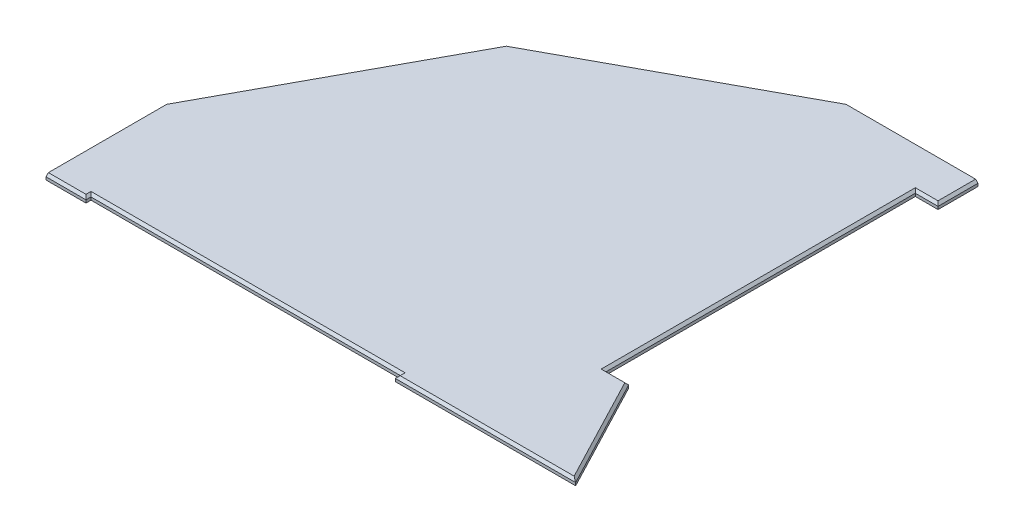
ISO-10303-21;
HEADER;
FILE_DESCRIPTION(('STEP AP214'),'2;1');
FILE_NAME('part.step','',(''),(''),'','','');
FILE_SCHEMA(('AUTOMOTIVE_DESIGN { 1 0 10303 214 1 1 1 1 }'));
ENDSEC;
DATA;
#1=APPLICATION_CONTEXT('core data for automotive mechanical design processes');
#2=APPLICATION_PROTOCOL_DEFINITION('international standard','automotive_design',2000,#1);
#3=PRODUCT_CONTEXT('',#1,'mechanical');
#4=PRODUCT('Part','Part','',(#3));
#5=PRODUCT_RELATED_PRODUCT_CATEGORY('part','',(#4));
#6=PRODUCT_DEFINITION_FORMATION('','',#4);
#7=PRODUCT_DEFINITION_CONTEXT('part definition',#1,'design');
#8=PRODUCT_DEFINITION('design','',#6,#7);
#9=PRODUCT_DEFINITION_SHAPE('','',#8);
#10=(LENGTH_UNIT() NAMED_UNIT(*) SI_UNIT(.MILLI.,.METRE.));
#11=(NAMED_UNIT(*) PLANE_ANGLE_UNIT() SI_UNIT($,.RADIAN.));
#12=(NAMED_UNIT(*) SI_UNIT($,.STERADIAN.) SOLID_ANGLE_UNIT());
#13=UNCERTAINTY_MEASURE_WITH_UNIT(LENGTH_MEASURE(1.E-05),#10,'distance_accuracy_value','');
#14=(GEOMETRIC_REPRESENTATION_CONTEXT(3) GLOBAL_UNCERTAINTY_ASSIGNED_CONTEXT((#13)) GLOBAL_UNIT_ASSIGNED_CONTEXT((#10,
#11,#12)) REPRESENTATION_CONTEXT('',''));
#15=CARTESIAN_POINT('',(0.,0.,0.));
#16=DIRECTION('',(0.,0.,1.));
#17=DIRECTION('',(1.,0.,0.));
#18=AXIS2_PLACEMENT_3D('',#15,#16,#17);
#19=CARTESIAN_POINT('',(145.16828136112,9.525,-591.552652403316));
#20=DIRECTION('',(0.476973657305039,0.,0.878917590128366));
#21=DIRECTION('',(0.878917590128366,0.,-0.47697365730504));
#22=AXIS2_PLACEMENT_3D('',#19,#20,#21);
#23=PLANE('',#22);
#24=DIRECTION('',(-0.878917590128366,0.,0.476973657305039));
#25=VECTOR('',#24,1.);
#26=CARTESIAN_POINT('',(145.16828136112,-9.525,-591.552652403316));
#27=LINE('',#26,#25);
#28=CARTESIAN_POINT('',(145.16828136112,-9.525,-591.552652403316));
#29=VERTEX_POINT('',#28);
#30=CARTESIAN_POINT('',(-405.744758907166,-9.525,-292.581496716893));
#31=VERTEX_POINT('',#30);
#32=EDGE_CURVE('E237',#29,#31,#27,.T.);
#33=ORIENTED_EDGE('',*,*,#32,.T.);
#34=DIRECTION('',(0.,-1.,0.));
#35=VECTOR('',#34,1.);
#36=CARTESIAN_POINT('',(-405.744758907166,9.525,-292.581496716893));
#37=LINE('',#36,#35);
#38=CARTESIAN_POINT('',(-405.744758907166,9.525,-292.581496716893));
#39=VERTEX_POINT('',#38);
#40=EDGE_CURVE('E220',#39,#31,#37,.T.);
#41=ORIENTED_EDGE('',*,*,#40,.F.);
#42=DIRECTION('',(-0.878917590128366,0.,0.476973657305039));
#43=VECTOR('',#42,1.);
#44=CARTESIAN_POINT('',(145.16828136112,9.525,-591.552652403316));
#45=LINE('',#44,#43);
#46=CARTESIAN_POINT('',(145.16828136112,9.525,-591.552652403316));
#47=VERTEX_POINT('',#46);
#48=EDGE_CURVE('E221',#47,#39,#45,.T.);
#49=ORIENTED_EDGE('',*,*,#48,.F.);
#50=DIRECTION('',(0.,-1.,0.));
#51=VECTOR('',#50,1.);
#52=CARTESIAN_POINT('',(145.16828136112,9.525,-591.552652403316));
#53=LINE('',#52,#51);
#54=EDGE_CURVE('E395',#47,#29,#53,.T.);
#55=ORIENTED_EDGE('',*,*,#54,.T.);
#56=EDGE_LOOP('',(#33,#41,#49,#55));
#57=FACE_BOUND('',#56,.T.);
#58=ADVANCED_FACE('F43',(#57),#23,.F.);
#59=CARTESIAN_POINT('',(-405.744758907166,9.525,-292.581496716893));
#60=DIRECTION('',(0.878917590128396,0.,0.476973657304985));
#61=DIRECTION('',(0.476973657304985,0.,-0.878917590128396));
#62=AXIS2_PLACEMENT_3D('',#59,#60,#61);
#63=PLANE('',#62);
#64=DIRECTION('',(-0.476973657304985,0.,0.878917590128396));
#65=VECTOR('',#64,1.);
#66=CARTESIAN_POINT('',(-405.744758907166,-9.525,-292.581496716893));
#67=LINE('',#66,#65);
#68=CARTESIAN_POINT('',(-704.715914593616,-9.525,258.331543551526));
#69=VERTEX_POINT('',#68);
#70=EDGE_CURVE('E398',#31,#69,#67,.T.);
#71=ORIENTED_EDGE('',*,*,#70,.T.);
#72=DIRECTION('',(0.,-1.,0.));
#73=VECTOR('',#72,1.);
#74=CARTESIAN_POINT('',(-704.715914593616,9.525,258.331543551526));
#75=LINE('',#74,#73);
#76=CARTESIAN_POINT('',(-704.715914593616,9.525,258.331543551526));
#77=VERTEX_POINT('',#76);
#78=EDGE_CURVE('E219',#77,#69,#75,.T.);
#79=ORIENTED_EDGE('',*,*,#78,.F.);
#80=DIRECTION('',(-0.476973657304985,0.,0.878917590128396));
#81=VECTOR('',#80,1.);
#82=CARTESIAN_POINT('',(-405.744758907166,9.525,-292.581496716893));
#83=LINE('',#82,#81);
#84=EDGE_CURVE('E213',#39,#77,#83,.T.);
#85=ORIENTED_EDGE('',*,*,#84,.F.);
#86=ORIENTED_EDGE('',*,*,#40,.T.);
#87=EDGE_LOOP('',(#71,#79,#85,#86));
#88=FACE_BOUND('',#87,.T.);
#89=ADVANCED_FACE('F214',(#88),#63,.F.);
#90=CARTESIAN_POINT('',(-704.715914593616,9.525,560.23764759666));
#91=DIRECTION('',(1.,0.,0.));
#92=DIRECTION('',(0.,0.,-1.));
#93=AXIS2_PLACEMENT_3D('',#90,#91,#92);
#94=PLANE('',#93);
#95=DIRECTION('',(0.,0.,1.));
#96=VECTOR('',#95,1.);
#97=CARTESIAN_POINT('',(-704.715914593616,-9.525,560.23764759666));
#98=LINE('',#97,#96);
#99=CARTESIAN_POINT('',(-704.715914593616,-9.525,554.23764759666));
#100=VERTEX_POINT('',#99);
#101=EDGE_CURVE('E402',#69,#100,#98,.T.);
#102=ORIENTED_EDGE('',*,*,#101,.T.);
#103=DIRECTION('',(0.,0.707106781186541,0.707106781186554));
#104=VECTOR('',#103,1.);
#105=CARTESIAN_POINT('',(-704.715914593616,-3.525,560.23764759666));
#106=LINE('',#105,#104);
#107=CARTESIAN_POINT('',(-704.715914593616,-3.52499999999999,560.23764759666));
#108=VERTEX_POINT('',#107);
#109=EDGE_CURVE('E267',#100,#108,#106,.T.);
#110=ORIENTED_EDGE('',*,*,#109,.T.);
#111=DIRECTION('',(0.,-1.,0.));
#112=VECTOR('',#111,1.);
#113=CARTESIAN_POINT('',(-704.715914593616,9.525,560.23764759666));
#114=LINE('',#113,#112);
#115=CARTESIAN_POINT('',(-704.715914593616,3.525,560.23764759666));
#116=VERTEX_POINT('',#115);
#117=EDGE_CURVE('E243',#116,#108,#114,.T.);
#118=ORIENTED_EDGE('',*,*,#117,.F.);
#119=DIRECTION('',(0.,-0.707106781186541,0.707106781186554));
#120=VECTOR('',#119,1.);
#121=CARTESIAN_POINT('',(-704.715914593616,9.525,554.23764759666));
#122=LINE('',#121,#120);
#123=CARTESIAN_POINT('',(-704.715914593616,9.525,554.23764759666));
#124=VERTEX_POINT('',#123);
#125=EDGE_CURVE('E270',#116,#124,#122,.F.);
#126=ORIENTED_EDGE('',*,*,#125,.T.);
#127=DIRECTION('',(0.,0.,1.));
#128=VECTOR('',#127,1.);
#129=CARTESIAN_POINT('',(-704.715914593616,9.525,560.23764759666));
#130=LINE('',#129,#128);
#131=EDGE_CURVE('E224',#77,#124,#130,.T.);
#132=ORIENTED_EDGE('',*,*,#131,.F.);
#133=ORIENTED_EDGE('',*,*,#78,.T.);
#134=EDGE_LOOP('',(#102,#110,#118,#126,#132,#133));
#135=FACE_BOUND('',#134,.T.);
#136=ADVANCED_FACE('F528',(#135),#94,.F.);
#137=CARTESIAN_POINT('',(-604.715914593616,9.525,560.23764759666));
#138=DIRECTION('',(0.,0.,-1.));
#139=DIRECTION('',(-1.,0.,0.));
#140=AXIS2_PLACEMENT_3D('',#137,#138,#139);
#141=PLANE('',#140);
#142=ORIENTED_EDGE('',*,*,#117,.T.);
#143=DIRECTION('',(1.,0.,0.));
#144=VECTOR('',#143,1.);
#145=CARTESIAN_POINT('',(-604.715914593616,-3.525,560.23764759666));
#146=LINE('',#145,#144);
#147=CARTESIAN_POINT('',(-604.715914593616,-3.52499999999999,560.23764759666));
#148=VERTEX_POINT('',#147);
#149=EDGE_CURVE('E239',#108,#148,#146,.T.);
#150=ORIENTED_EDGE('',*,*,#149,.T.);
#151=DIRECTION('',(0.,-1.,0.));
#152=VECTOR('',#151,1.);
#153=CARTESIAN_POINT('',(-604.715914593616,9.525,560.23764759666));
#154=LINE('',#153,#152);
#155=CARTESIAN_POINT('',(-604.715914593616,3.525,560.23764759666));
#156=VERTEX_POINT('',#155);
#157=EDGE_CURVE('E429',#156,#148,#154,.T.);
#158=ORIENTED_EDGE('',*,*,#157,.F.);
#159=DIRECTION('',(-1.,0.,0.));
#160=VECTOR('',#159,1.);
#161=CARTESIAN_POINT('',(-604.715914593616,3.525,560.23764759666));
#162=LINE('',#161,#160);
#163=EDGE_CURVE('E240',#156,#116,#162,.T.);
#164=ORIENTED_EDGE('',*,*,#163,.T.);
#165=EDGE_LOOP('',(#142,#150,#158,#164));
#166=FACE_BOUND('',#165,.T.);
#167=ADVANCED_FACE('F436',(#166),#141,.F.);
#168=CARTESIAN_POINT('',(-604.715914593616,9.525,547.71264759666));
#169=DIRECTION('',(-1.,0.,0.));
#170=DIRECTION('',(0.,0.,1.));
#171=AXIS2_PLACEMENT_3D('',#168,#169,#170);
#172=PLANE('',#171);
#173=ORIENTED_EDGE('',*,*,#157,.T.);
#174=DIRECTION('',(0.,0.,-1.));
#175=VECTOR('',#174,1.);
#176=CARTESIAN_POINT('',(-604.715914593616,-3.525,547.71264759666));
#177=LINE('',#176,#175);
#178=CARTESIAN_POINT('',(-604.715914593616,-3.52499999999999,547.71264759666));
#179=VERTEX_POINT('',#178);
#180=EDGE_CURVE('E272',#148,#179,#177,.T.);
#181=ORIENTED_EDGE('',*,*,#180,.T.);
#182=DIRECTION('',(0.,-1.,0.));
#183=VECTOR('',#182,1.);
#184=CARTESIAN_POINT('',(-604.715914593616,9.525,547.71264759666));
#185=LINE('',#184,#183);
#186=CARTESIAN_POINT('',(-604.715914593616,3.525,547.71264759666));
#187=VERTEX_POINT('',#186);
#188=EDGE_CURVE('E430',#187,#179,#185,.T.);
#189=ORIENTED_EDGE('',*,*,#188,.F.);
#190=DIRECTION('',(0.,0.,1.));
#191=VECTOR('',#190,1.);
#192=CARTESIAN_POINT('',(-604.715914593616,3.525,547.71264759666));
#193=LINE('',#192,#191);
#194=EDGE_CURVE('E271',#187,#156,#193,.T.);
#195=ORIENTED_EDGE('',*,*,#194,.T.);
#196=EDGE_LOOP('',(#173,#181,#189,#195));
#197=FACE_BOUND('',#196,.T.);
#198=ADVANCED_FACE('F452',(#197),#172,.F.);
#199=CARTESIAN_POINT('',(-604.715914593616,9.525,547.71264759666));
#200=DIRECTION('',(0.,0.,-1.));
#201=DIRECTION('',(-1.,0.,0.));
#202=AXIS2_PLACEMENT_3D('',#199,#200,#201);
#203=PLANE('',#202);
#204=ORIENTED_EDGE('',*,*,#188,.T.);
#205=DIRECTION('',(1.,0.,0.));
#206=VECTOR('',#205,1.);
#207=CARTESIAN_POINT('',(169.284085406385,-3.525,547.71264759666));
#208=LINE('',#207,#206);
#209=CARTESIAN_POINT('',(169.284085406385,-3.52499999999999,547.71264759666));
#210=VERTEX_POINT('',#209);
#211=EDGE_CURVE('E280',#179,#210,#208,.T.);
#212=ORIENTED_EDGE('',*,*,#211,.T.);
#213=DIRECTION('',(0.,-1.,0.));
#214=VECTOR('',#213,1.);
#215=CARTESIAN_POINT('',(169.284085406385,9.525,547.71264759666));
#216=LINE('',#215,#214);
#217=CARTESIAN_POINT('',(169.284085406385,3.525,547.71264759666));
#218=VERTEX_POINT('',#217);
#219=EDGE_CURVE('E424',#218,#210,#216,.T.);
#220=ORIENTED_EDGE('',*,*,#219,.F.);
#221=DIRECTION('',(-1.,0.,0.));
#222=VECTOR('',#221,1.);
#223=CARTESIAN_POINT('',(-604.715914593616,3.525,547.71264759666));
#224=LINE('',#223,#222);
#225=EDGE_CURVE('E274',#218,#187,#224,.T.);
#226=ORIENTED_EDGE('',*,*,#225,.T.);
#227=EDGE_LOOP('',(#204,#212,#220,#226));
#228=FACE_BOUND('',#227,.T.);
#229=ADVANCED_FACE('F457',(#228),#203,.F.);
#230=CARTESIAN_POINT('',(169.284085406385,9.525,547.71264759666));
#231=DIRECTION('',(1.,0.,0.));
#232=DIRECTION('',(0.,0.,-1.));
#233=AXIS2_PLACEMENT_3D('',#230,#231,#232);
#234=PLANE('',#233);
#235=ORIENTED_EDGE('',*,*,#219,.T.);
#236=DIRECTION('',(0.,0.,1.));
#237=VECTOR('',#236,1.);
#238=CARTESIAN_POINT('',(169.284085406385,-3.525,560.23764759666));
#239=LINE('',#238,#237);
#240=CARTESIAN_POINT('',(169.284085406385,-3.52499999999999,560.23764759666));
#241=VERTEX_POINT('',#240);
#242=EDGE_CURVE('E283',#210,#241,#239,.T.);
#243=ORIENTED_EDGE('',*,*,#242,.T.);
#244=DIRECTION('',(0.,-1.,0.));
#245=VECTOR('',#244,1.);
#246=CARTESIAN_POINT('',(169.284085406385,9.525,560.23764759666));
#247=LINE('',#246,#245);
#248=CARTESIAN_POINT('',(169.284085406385,3.525,560.23764759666));
#249=VERTEX_POINT('',#248);
#250=EDGE_CURVE('E423',#249,#241,#247,.T.);
#251=ORIENTED_EDGE('',*,*,#250,.F.);
#252=DIRECTION('',(0.,0.,-1.));
#253=VECTOR('',#252,1.);
#254=CARTESIAN_POINT('',(169.284085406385,3.525,547.71264759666));
#255=LINE('',#254,#253);
#256=EDGE_CURVE('E276',#249,#218,#255,.T.);
#257=ORIENTED_EDGE('',*,*,#256,.T.);
#258=EDGE_LOOP('',(#235,#243,#251,#257));
#259=FACE_BOUND('',#258,.T.);
#260=ADVANCED_FACE('F470',(#259),#234,.F.);
#261=CARTESIAN_POINT('',(620.484085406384,9.525,560.23764759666));
#262=DIRECTION('',(0.,0.,-1.));
#263=DIRECTION('',(-1.,0.,0.));
#264=AXIS2_PLACEMENT_3D('',#261,#262,#263);
#265=PLANE('',#264);
#266=ORIENTED_EDGE('',*,*,#250,.T.);
#267=DIRECTION('',(1.,0.,0.));
#268=VECTOR('',#267,1.);
#269=CARTESIAN_POINT('',(620.484085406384,-3.525,560.23764759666));
#270=LINE('',#269,#268);
#271=CARTESIAN_POINT('',(620.484085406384,-3.52499999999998,560.23764759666));
#272=VERTEX_POINT('',#271);
#273=EDGE_CURVE('E284',#241,#272,#270,.T.);
#274=ORIENTED_EDGE('',*,*,#273,.T.);
#275=DIRECTION('',(0.,-1.,0.));
#276=VECTOR('',#275,1.);
#277=CARTESIAN_POINT('',(620.484085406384,9.525,560.23764759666));
#278=LINE('',#277,#276);
#279=CARTESIAN_POINT('',(620.484085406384,3.52500000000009,560.23764759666));
#280=VERTEX_POINT('',#279);
#281=EDGE_CURVE('E416',#280,#272,#278,.T.);
#282=ORIENTED_EDGE('',*,*,#281,.F.);
#283=DIRECTION('',(-1.,0.,0.));
#284=VECTOR('',#283,1.);
#285=CARTESIAN_POINT('',(620.484085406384,3.525,560.23764759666));
#286=LINE('',#285,#284);
#287=EDGE_CURVE('E281',#280,#249,#286,.T.);
#288=ORIENTED_EDGE('',*,*,#287,.T.);
#289=EDGE_LOOP('',(#266,#274,#282,#288));
#290=FACE_BOUND('',#289,.T.);
#291=ADVANCED_FACE('F475',(#290),#265,.F.);
#292=CARTESIAN_POINT('',(620.484085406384,9.525,560.23764759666));
#293=DIRECTION('',(-0.886253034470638,0.,0.463201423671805));
#294=DIRECTION('',(0.463201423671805,0.,0.886253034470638));
#295=AXIS2_PLACEMENT_3D('',#292,#293,#294);
#296=PLANE('',#295);
#297=ORIENTED_EDGE('',*,*,#281,.T.);
#298=DIRECTION('',(-0.463201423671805,0.,-0.886253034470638));
#299=VECTOR('',#298,1.);
#300=CARTESIAN_POINT('',(475.296585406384,-3.52499999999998,282.447347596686));
#301=LINE('',#300,#299);
#302=CARTESIAN_POINT('',(475.296585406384,-3.52499999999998,282.447347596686));
#303=VERTEX_POINT('',#302);
#304=EDGE_CURVE('E310',#272,#303,#301,.T.);
#305=ORIENTED_EDGE('',*,*,#304,.T.);
#306=DIRECTION('',(0.,-1.,0.));
#307=VECTOR('',#306,1.);
#308=CARTESIAN_POINT('',(475.296585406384,9.525,282.447347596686));
#309=LINE('',#308,#307);
#310=CARTESIAN_POINT('',(475.296585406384,3.52500000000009,282.447347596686));
#311=VERTEX_POINT('',#310);
#312=EDGE_CURVE('E415',#311,#303,#309,.T.);
#313=ORIENTED_EDGE('',*,*,#312,.F.);
#314=DIRECTION('',(0.463201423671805,0.,0.886253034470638));
#315=VECTOR('',#314,1.);
#316=CARTESIAN_POINT('',(620.484085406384,3.52500000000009,560.23764759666));
#317=LINE('',#316,#315);
#318=EDGE_CURVE('E307',#311,#280,#317,.T.);
#319=ORIENTED_EDGE('',*,*,#318,.T.);
#320=EDGE_LOOP('',(#297,#305,#313,#319));
#321=FACE_BOUND('',#320,.T.);
#322=ADVANCED_FACE('F488',(#321),#296,.F.);
#323=CARTESIAN_POINT('',(418.496585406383,9.525,282.447347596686));
#324=DIRECTION('',(0.,0.,1.));
#325=DIRECTION('',(1.,0.,0.));
#326=AXIS2_PLACEMENT_3D('',#323,#324,#325);
#327=PLANE('',#326);
#328=ORIENTED_EDGE('',*,*,#312,.T.);
#329=DIRECTION('',(-1.,0.,0.));
#330=VECTOR('',#329,1.);
#331=CARTESIAN_POINT('',(418.496585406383,-3.525,282.447347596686));
#332=LINE('',#331,#330);
#333=CARTESIAN_POINT('',(418.496585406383,-3.52499999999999,282.447347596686));
#334=VERTEX_POINT('',#333);
#335=EDGE_CURVE('E305',#303,#334,#332,.T.);
#336=ORIENTED_EDGE('',*,*,#335,.T.);
#337=DIRECTION('',(0.,-1.,0.));
#338=VECTOR('',#337,1.);
#339=CARTESIAN_POINT('',(418.496585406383,9.525,282.447347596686));
#340=LINE('',#339,#338);
#341=CARTESIAN_POINT('',(418.496585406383,3.525,282.447347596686));
#342=VERTEX_POINT('',#341);
#343=EDGE_CURVE('E412',#342,#334,#340,.T.);
#344=ORIENTED_EDGE('',*,*,#343,.F.);
#345=DIRECTION('',(1.,0.,0.));
#346=VECTOR('',#345,1.);
#347=CARTESIAN_POINT('',(418.496585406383,3.525,282.447347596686));
#348=LINE('',#347,#346);
#349=EDGE_CURVE('E304',#342,#311,#348,.T.);
#350=ORIENTED_EDGE('',*,*,#349,.T.);
#351=EDGE_LOOP('',(#328,#336,#344,#350));
#352=FACE_BOUND('',#351,.T.);
#353=ADVANCED_FACE('F495',(#352),#327,.F.);
#354=CARTESIAN_POINT('',(418.496585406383,9.525,282.447347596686));
#355=DIRECTION('',(-1.,0.,0.));
#356=DIRECTION('',(0.,0.,1.));
#357=AXIS2_PLACEMENT_3D('',#354,#355,#356);
#358=PLANE('',#357);
#359=ORIENTED_EDGE('',*,*,#343,.T.);
#360=DIRECTION('',(0.,0.,-1.));
#361=VECTOR('',#360,1.);
#362=CARTESIAN_POINT('',(418.496585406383,-3.525,-491.552652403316));
#363=LINE('',#362,#361);
#364=CARTESIAN_POINT('',(418.496585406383,-3.52499999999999,-491.552652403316));
#365=VERTEX_POINT('',#364);
#366=EDGE_CURVE('E301',#334,#365,#363,.T.);
#367=ORIENTED_EDGE('',*,*,#366,.T.);
#368=DIRECTION('',(0.,-1.,0.));
#369=VECTOR('',#368,1.);
#370=CARTESIAN_POINT('',(418.496585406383,9.525,-491.552652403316));
#371=LINE('',#370,#369);
#372=CARTESIAN_POINT('',(418.496585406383,3.525,-491.552652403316));
#373=VERTEX_POINT('',#372);
#374=EDGE_CURVE('E407',#373,#365,#371,.T.);
#375=ORIENTED_EDGE('',*,*,#374,.F.);
#376=DIRECTION('',(0.,0.,1.));
#377=VECTOR('',#376,1.);
#378=CARTESIAN_POINT('',(418.496585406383,3.525,282.447347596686));
#379=LINE('',#378,#377);
#380=EDGE_CURVE('E297',#373,#342,#379,.T.);
#381=ORIENTED_EDGE('',*,*,#380,.T.);
#382=EDGE_LOOP('',(#359,#367,#375,#381));
#383=FACE_BOUND('',#382,.T.);
#384=ADVANCED_FACE('F506',(#383),#358,.F.);
#385=CARTESIAN_POINT('',(418.496585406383,9.525,-491.552652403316));
#386=DIRECTION('',(0.,0.,-1.));
#387=DIRECTION('',(-1.,0.,0.));
#388=AXIS2_PLACEMENT_3D('',#385,#386,#387);
#389=PLANE('',#388);
#390=ORIENTED_EDGE('',*,*,#374,.T.);
#391=DIRECTION('',(1.,0.,0.));
#392=VECTOR('',#391,1.);
#393=CARTESIAN_POINT('',(475.296585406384,-3.525,-491.552652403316));
#394=LINE('',#393,#392);
#395=CARTESIAN_POINT('',(475.296585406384,-3.52499999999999,-491.552652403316));
#396=VERTEX_POINT('',#395);
#397=EDGE_CURVE('E300',#365,#396,#394,.T.);
#398=ORIENTED_EDGE('',*,*,#397,.T.);
#399=DIRECTION('',(0.,-1.,0.));
#400=VECTOR('',#399,1.);
#401=CARTESIAN_POINT('',(475.296585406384,9.525,-491.552652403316));
#402=LINE('',#401,#400);
#403=CARTESIAN_POINT('',(475.296585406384,3.525,-491.552652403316));
#404=VERTEX_POINT('',#403);
#405=EDGE_CURVE('E408',#404,#396,#402,.T.);
#406=ORIENTED_EDGE('',*,*,#405,.F.);
#407=DIRECTION('',(-1.,0.,0.));
#408=VECTOR('',#407,1.);
#409=CARTESIAN_POINT('',(418.496585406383,3.525,-491.552652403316));
#410=LINE('',#409,#408);
#411=EDGE_CURVE('E293',#404,#373,#410,.T.);
#412=ORIENTED_EDGE('',*,*,#411,.T.);
#413=EDGE_LOOP('',(#390,#398,#406,#412));
#414=FACE_BOUND('',#413,.T.);
#415=ADVANCED_FACE('F508',(#414),#389,.F.);
#416=CARTESIAN_POINT('',(475.296585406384,9.525,-491.552652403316));
#417=DIRECTION('',(-1.,0.,0.));
#418=DIRECTION('',(0.,0.,1.));
#419=AXIS2_PLACEMENT_3D('',#416,#417,#418);
#420=PLANE('',#419);
#421=ORIENTED_EDGE('',*,*,#405,.T.);
#422=DIRECTION('',(0.,0.,-1.));
#423=VECTOR('',#422,1.);
#424=CARTESIAN_POINT('',(475.296585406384,-3.525,-591.552652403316));
#425=LINE('',#424,#423);
#426=CARTESIAN_POINT('',(475.296585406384,-3.52499999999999,-591.552652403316));
#427=VERTEX_POINT('',#426);
#428=EDGE_CURVE('E288',#396,#427,#425,.T.);
#429=ORIENTED_EDGE('',*,*,#428,.T.);
#430=DIRECTION('',(0.,-1.,0.));
#431=VECTOR('',#430,1.);
#432=CARTESIAN_POINT('',(475.296585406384,9.525,-591.552652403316));
#433=LINE('',#432,#431);
#434=CARTESIAN_POINT('',(475.296585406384,3.525,-591.552652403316));
#435=VERTEX_POINT('',#434);
#436=EDGE_CURVE('E392',#435,#427,#433,.T.);
#437=ORIENTED_EDGE('',*,*,#436,.F.);
#438=DIRECTION('',(0.,0.,1.));
#439=VECTOR('',#438,1.);
#440=CARTESIAN_POINT('',(475.296585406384,3.525,-491.552652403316));
#441=LINE('',#440,#439);
#442=EDGE_CURVE('E287',#435,#404,#441,.T.);
#443=ORIENTED_EDGE('',*,*,#442,.T.);
#444=EDGE_LOOP('',(#421,#429,#437,#443));
#445=FACE_BOUND('',#444,.T.);
#446=ADVANCED_FACE('F521',(#445),#420,.F.);
#447=CARTESIAN_POINT('',(475.296585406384,9.525,-591.552652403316));
#448=DIRECTION('',(0.,0.,1.));
#449=DIRECTION('',(1.,0.,0.));
#450=AXIS2_PLACEMENT_3D('',#447,#448,#449);
#451=PLANE('',#450);
#452=ORIENTED_EDGE('',*,*,#436,.T.);
#453=DIRECTION('',(-0.707106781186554,-0.707106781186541,0.));
#454=VECTOR('',#453,1.);
#455=CARTESIAN_POINT('',(475.296585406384,-3.525,-591.552652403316));
#456=LINE('',#455,#454);
#457=CARTESIAN_POINT('',(469.296585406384,-9.525,-591.552652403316));
#458=VERTEX_POINT('',#457);
#459=EDGE_CURVE('E291',#427,#458,#456,.T.);
#460=ORIENTED_EDGE('',*,*,#459,.T.);
#461=DIRECTION('',(-1.,0.,0.));
#462=VECTOR('',#461,1.);
#463=CARTESIAN_POINT('',(475.296585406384,-9.525,-591.552652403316));
#464=LINE('',#463,#462);
#465=EDGE_CURVE('E234',#458,#29,#464,.T.);
#466=ORIENTED_EDGE('',*,*,#465,.T.);
#467=ORIENTED_EDGE('',*,*,#54,.F.);
#468=DIRECTION('',(-1.,0.,0.));
#469=VECTOR('',#468,1.);
#470=CARTESIAN_POINT('',(475.296585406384,9.525,-591.552652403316));
#471=LINE('',#470,#469);
#472=CARTESIAN_POINT('',(469.296585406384,9.525,-591.552652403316));
#473=VERTEX_POINT('',#472);
#474=EDGE_CURVE('E227',#473,#47,#471,.T.);
#475=ORIENTED_EDGE('',*,*,#474,.F.);
#476=DIRECTION('',(-0.707106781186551,0.707106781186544,0.));
#477=VECTOR('',#476,1.);
#478=CARTESIAN_POINT('',(469.296585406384,9.525,-591.552652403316));
#479=LINE('',#478,#477);
#480=EDGE_CURVE('E292',#473,#435,#479,.F.);
#481=ORIENTED_EDGE('',*,*,#480,.T.);
#482=EDGE_LOOP('',(#452,#460,#466,#467,#475,#481));
#483=FACE_BOUND('',#482,.T.);
#484=ADVANCED_FACE('F388',(#483),#451,.F.);
#485=CARTESIAN_POINT('',(0.,9.525,0.));
#486=DIRECTION('',(0.,-1.,0.));
#487=DIRECTION('',(0.,0.,-1.));
#488=AXIS2_PLACEMENT_3D('',#485,#486,#487);
#489=PLANE('',#488);
#490=ORIENTED_EDGE('',*,*,#131,.T.);
#491=DIRECTION('',(1.,0.,0.));
#492=VECTOR('',#491,1.);
#493=CARTESIAN_POINT('',(0.,9.525,554.23764759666));
#494=LINE('',#493,#492);
#495=CARTESIAN_POINT('',(-610.715914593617,9.525,554.23764759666));
#496=VERTEX_POINT('',#495);
#497=EDGE_CURVE('E11',#124,#496,#494,.T.);
#498=ORIENTED_EDGE('',*,*,#497,.T.);
#499=DIRECTION('',(0.,0.,-1.));
#500=VECTOR('',#499,1.);
#501=CARTESIAN_POINT('',(-610.715914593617,9.525,0.));
#502=LINE('',#501,#500);
#503=CARTESIAN_POINT('',(-610.715914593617,9.525,541.71264759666));
#504=VERTEX_POINT('',#503);
#505=EDGE_CURVE('E52',#496,#504,#502,.T.);
#506=ORIENTED_EDGE('',*,*,#505,.T.);
#507=DIRECTION('',(1.,0.,0.));
#508=VECTOR('',#507,1.);
#509=CARTESIAN_POINT('',(0.,9.525,541.71264759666));
#510=LINE('',#509,#508);
#511=CARTESIAN_POINT('',(175.284085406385,9.525,541.71264759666));
#512=VERTEX_POINT('',#511);
#513=EDGE_CURVE('E324',#504,#512,#510,.T.);
#514=ORIENTED_EDGE('',*,*,#513,.T.);
#515=DIRECTION('',(0.,0.,1.));
#516=VECTOR('',#515,1.);
#517=CARTESIAN_POINT('',(175.284085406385,9.525,0.));
#518=LINE('',#517,#516);
#519=CARTESIAN_POINT('',(175.284085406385,9.525,554.23764759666));
#520=VERTEX_POINT('',#519);
#521=EDGE_CURVE('E323',#512,#520,#518,.T.);
#522=ORIENTED_EDGE('',*,*,#521,.T.);
#523=DIRECTION('',(1.,0.,0.));
#524=VECTOR('',#523,1.);
#525=CARTESIAN_POINT('',(0.,9.525,554.23764759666));
#526=LINE('',#525,#524);
#527=CARTESIAN_POINT('',(610.5781012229,9.525,554.23764759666));
#528=VERTEX_POINT('',#527);
#529=EDGE_CURVE('E321',#520,#528,#526,.T.);
#530=ORIENTED_EDGE('',*,*,#529,.T.);
#531=DIRECTION('',(-0.463201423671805,0.,-0.886253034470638));
#532=VECTOR('',#531,1.);
#533=CARTESIAN_POINT('',(252.053046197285,9.525,-131.73588726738));
#534=LINE('',#533,#532);
#535=CARTESIAN_POINT('',(471.662418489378,9.525,288.447347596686));
#536=VERTEX_POINT('',#535);
#537=EDGE_CURVE('E313',#528,#536,#534,.T.);
#538=ORIENTED_EDGE('',*,*,#537,.T.);
#539=DIRECTION('',(-1.,0.,0.));
#540=VECTOR('',#539,1.);
#541=CARTESIAN_POINT('',(0.,9.525,288.447347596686));
#542=LINE('',#541,#540);
#543=CARTESIAN_POINT('',(412.496585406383,9.525,288.447347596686));
#544=VERTEX_POINT('',#543);
#545=EDGE_CURVE('E311',#536,#544,#542,.T.);
#546=ORIENTED_EDGE('',*,*,#545,.T.);
#547=DIRECTION('',(0.,0.,-1.));
#548=VECTOR('',#547,1.);
#549=CARTESIAN_POINT('',(412.496585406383,9.525,0.));
#550=LINE('',#549,#548);
#551=CARTESIAN_POINT('',(412.496585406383,9.525,-497.552652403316));
#552=VERTEX_POINT('',#551);
#553=EDGE_CURVE('E312',#544,#552,#550,.T.);
#554=ORIENTED_EDGE('',*,*,#553,.T.);
#555=DIRECTION('',(1.,0.,0.));
#556=VECTOR('',#555,1.);
#557=CARTESIAN_POINT('',(0.,9.525,-497.552652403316));
#558=LINE('',#557,#556);
#559=CARTESIAN_POINT('',(469.296585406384,9.525,-497.552652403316));
#560=VERTEX_POINT('',#559);
#561=EDGE_CURVE('E320',#552,#560,#558,.T.);
#562=ORIENTED_EDGE('',*,*,#561,.T.);
#563=DIRECTION('',(0.,0.,-1.));
#564=VECTOR('',#563,1.);
#565=CARTESIAN_POINT('',(469.296585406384,9.525,0.));
#566=LINE('',#565,#564);
#567=EDGE_CURVE('E317',#560,#473,#566,.T.);
#568=ORIENTED_EDGE('',*,*,#567,.T.);
#569=ORIENTED_EDGE('',*,*,#474,.T.);
#570=ORIENTED_EDGE('',*,*,#48,.T.);
#571=ORIENTED_EDGE('',*,*,#84,.T.);
#572=EDGE_LOOP('',(#490,#498,#506,#514,#522,#530,#538,#546,#554,#562,#568,#569,#570,#571));
#573=FACE_BOUND('',#572,.T.);
#574=ADVANCED_FACE('F230',(#573),#489,.F.);
#575=CARTESIAN_POINT('',(0.,-9.525,0.));
#576=DIRECTION('',(0.,-1.,0.));
#577=DIRECTION('',(0.,0.,-1.));
#578=AXIS2_PLACEMENT_3D('',#575,#576,#577);
#579=PLANE('',#578);
#580=DIRECTION('',(0.,0.,1.));
#581=VECTOR('',#580,1.);
#582=CARTESIAN_POINT('',(-610.715914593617,-9.525,560.23764759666));
#583=LINE('',#582,#581);
#584=CARTESIAN_POINT('',(-610.715914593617,-9.525,541.71264759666));
#585=VERTEX_POINT('',#584);
#586=CARTESIAN_POINT('',(-610.715914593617,-9.525,554.23764759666));
#587=VERTEX_POINT('',#586);
#588=EDGE_CURVE('E263',#585,#587,#583,.T.);
#589=ORIENTED_EDGE('',*,*,#588,.T.);
#590=DIRECTION('',(-1.,0.,0.));
#591=VECTOR('',#590,1.);
#592=CARTESIAN_POINT('',(-704.715914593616,-9.525,554.23764759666));
#593=LINE('',#592,#591);
#594=EDGE_CURVE('E264',#587,#100,#593,.T.);
#595=ORIENTED_EDGE('',*,*,#594,.T.);
#596=ORIENTED_EDGE('',*,*,#101,.F.);
#597=ORIENTED_EDGE('',*,*,#70,.F.);
#598=ORIENTED_EDGE('',*,*,#32,.F.);
#599=ORIENTED_EDGE('',*,*,#465,.F.);
#600=DIRECTION('',(0.,0.,1.));
#601=VECTOR('',#600,1.);
#602=CARTESIAN_POINT('',(469.296585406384,-9.525,-491.552652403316));
#603=LINE('',#602,#601);
#604=CARTESIAN_POINT('',(469.296585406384,-9.525,-497.552652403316));
#605=VERTEX_POINT('',#604);
#606=EDGE_CURVE('E254',#458,#605,#603,.T.);
#607=ORIENTED_EDGE('',*,*,#606,.T.);
#608=DIRECTION('',(-1.,0.,0.));
#609=VECTOR('',#608,1.);
#610=CARTESIAN_POINT('',(418.496585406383,-9.525,-497.552652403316));
#611=LINE('',#610,#609);
#612=CARTESIAN_POINT('',(412.496585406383,-9.525,-497.552652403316));
#613=VERTEX_POINT('',#612);
#614=EDGE_CURVE('E251',#605,#613,#611,.T.);
#615=ORIENTED_EDGE('',*,*,#614,.T.);
#616=DIRECTION('',(0.,0.,1.));
#617=VECTOR('',#616,1.);
#618=CARTESIAN_POINT('',(412.496585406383,-9.525,282.447347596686));
#619=LINE('',#618,#617);
#620=CARTESIAN_POINT('',(412.496585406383,-9.525,288.447347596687));
#621=VERTEX_POINT('',#620);
#622=EDGE_CURVE('E253',#613,#621,#619,.T.);
#623=ORIENTED_EDGE('',*,*,#622,.T.);
#624=DIRECTION('',(1.,0.,0.));
#625=VECTOR('',#624,1.);
#626=CARTESIAN_POINT('',(475.296585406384,-9.525,288.447347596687));
#627=LINE('',#626,#625);
#628=CARTESIAN_POINT('',(471.662418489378,-9.525,288.447347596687));
#629=VERTEX_POINT('',#628);
#630=EDGE_CURVE('E248',#621,#629,#627,.T.);
#631=ORIENTED_EDGE('',*,*,#630,.T.);
#632=DIRECTION('',(0.463201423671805,0.,0.886253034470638));
#633=VECTOR('',#632,1.);
#634=CARTESIAN_POINT('',(615.16656719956,-9.525,563.016856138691));
#635=LINE('',#634,#633);
#636=CARTESIAN_POINT('',(610.5781012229,-9.525,554.23764759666));
#637=VERTEX_POINT('',#636);
#638=EDGE_CURVE('E247',#629,#637,#635,.T.);
#639=ORIENTED_EDGE('',*,*,#638,.T.);
#640=DIRECTION('',(-1.,0.,0.));
#641=VECTOR('',#640,1.);
#642=CARTESIAN_POINT('',(169.284085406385,-9.525,554.23764759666));
#643=LINE('',#642,#641);
#644=CARTESIAN_POINT('',(175.284085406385,-9.525,554.23764759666));
#645=VERTEX_POINT('',#644);
#646=EDGE_CURVE('E260',#637,#645,#643,.T.);
#647=ORIENTED_EDGE('',*,*,#646,.T.);
#648=DIRECTION('',(0.,0.,-1.));
#649=VECTOR('',#648,1.);
#650=CARTESIAN_POINT('',(175.284085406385,-9.525,547.71264759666));
#651=LINE('',#650,#649);
#652=CARTESIAN_POINT('',(175.284085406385,-9.525,541.71264759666));
#653=VERTEX_POINT('',#652);
#654=EDGE_CURVE('E259',#645,#653,#651,.T.);
#655=ORIENTED_EDGE('',*,*,#654,.T.);
#656=DIRECTION('',(-1.,0.,0.));
#657=VECTOR('',#656,1.);
#658=CARTESIAN_POINT('',(-604.715914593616,-9.525,541.71264759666));
#659=LINE('',#658,#657);
#660=EDGE_CURVE('E261',#653,#585,#659,.T.);
#661=ORIENTED_EDGE('',*,*,#660,.T.);
#662=EDGE_LOOP('',(#589,#595,#596,#597,#598,#599,#607,#615,#623,#631,#639,#647,#655,#661));
#663=FACE_BOUND('',#662,.T.);
#664=ADVANCED_FACE('F523',(#663),#579,.T.);
#665=CARTESIAN_POINT('',(475.296585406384,-3.525,-491.552652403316));
#666=DIRECTION('',(0.707106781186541,-0.707106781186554,0.));
#667=DIRECTION('',(0.,0.,1.));
#668=AXIS2_PLACEMENT_3D('',#665,#666,#667);
#669=PLANE('',#668);
#670=ORIENTED_EDGE('',*,*,#459,.F.);
#671=ORIENTED_EDGE('',*,*,#428,.F.);
#672=DIRECTION('',(0.577350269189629,0.577350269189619,0.577350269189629));
#673=VECTOR('',#672,1.);
#674=CARTESIAN_POINT('',(456.36325207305,-22.4583333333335,-510.48598573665));
#675=LINE('',#674,#673);
#676=EDGE_CURVE('E353',#605,#396,#675,.T.);
#677=ORIENTED_EDGE('',*,*,#676,.F.);
#678=ORIENTED_EDGE('',*,*,#606,.F.);
#679=EDGE_LOOP('',(#670,#671,#677,#678));
#680=FACE_BOUND('',#679,.T.);
#681=ADVANCED_FACE('F517',(#680),#669,.T.);
#682=CARTESIAN_POINT('',(418.496585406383,-3.525,-491.552652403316));
#683=DIRECTION('',(0.,-0.707106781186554,0.707106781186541));
#684=DIRECTION('',(-1.,0.,0.));
#685=AXIS2_PLACEMENT_3D('',#682,#683,#684);
#686=PLANE('',#685);
#687=ORIENTED_EDGE('',*,*,#676,.T.);
#688=ORIENTED_EDGE('',*,*,#397,.F.);
#689=DIRECTION('',(0.577350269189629,0.577350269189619,0.577350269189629));
#690=VECTOR('',#689,1.);
#691=CARTESIAN_POINT('',(418.496585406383,-3.525,-491.552652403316));
#692=LINE('',#691,#690);
#693=EDGE_CURVE('E346',#613,#365,#692,.T.);
#694=ORIENTED_EDGE('',*,*,#693,.F.);
#695=ORIENTED_EDGE('',*,*,#614,.F.);
#696=EDGE_LOOP('',(#687,#688,#694,#695));
#697=FACE_BOUND('',#696,.T.);
#698=ADVANCED_FACE('F515',(#697),#686,.T.);
#699=CARTESIAN_POINT('',(418.496585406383,-3.525,282.447347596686));
#700=DIRECTION('',(0.707106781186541,-0.707106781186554,0.));
#701=DIRECTION('',(0.,0.,1.));
#702=AXIS2_PLACEMENT_3D('',#699,#700,#701);
#703=PLANE('',#702);
#704=ORIENTED_EDGE('',*,*,#693,.T.);
#705=ORIENTED_EDGE('',*,*,#366,.F.);
#706=DIRECTION('',(0.577350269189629,0.577350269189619,-0.577350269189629));
#707=VECTOR('',#706,1.);
#708=CARTESIAN_POINT('',(418.496585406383,-3.525,282.447347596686));
#709=LINE('',#708,#707);
#710=EDGE_CURVE('E345',#621,#334,#709,.T.);
#711=ORIENTED_EDGE('',*,*,#710,.F.);
#712=ORIENTED_EDGE('',*,*,#622,.F.);
#713=EDGE_LOOP('',(#704,#705,#711,#712));
#714=FACE_BOUND('',#713,.T.);
#715=ADVANCED_FACE('F505',(#714),#703,.T.);
#716=CARTESIAN_POINT('',(418.496585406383,-3.525,282.447347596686));
#717=DIRECTION('',(0.,-0.707106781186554,-0.707106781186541));
#718=DIRECTION('',(1.,0.,0.));
#719=AXIS2_PLACEMENT_3D('',#716,#717,#718);
#720=PLANE('',#719);
#721=ORIENTED_EDGE('',*,*,#710,.T.);
#722=ORIENTED_EDGE('',*,*,#335,.F.);
#723=DIRECTION('',(0.393701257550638,0.649999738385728,-0.64999973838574));
#724=VECTOR('',#723,1.);
#725=CARTESIAN_POINT('',(426.712621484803,-83.7369963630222,362.65934395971));
#726=LINE('',#725,#724);
#727=EDGE_CURVE('E342',#629,#303,#726,.T.);
#728=ORIENTED_EDGE('',*,*,#727,.F.);
#729=ORIENTED_EDGE('',*,*,#630,.F.);
#730=EDGE_LOOP('',(#721,#722,#728,#729));
#731=FACE_BOUND('',#730,.T.);
#732=ADVANCED_FACE('F497',(#731),#720,.T.);
#733=CARTESIAN_POINT('',(620.484085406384,-3.525,560.23764759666));
#734=DIRECTION('',(0.62667553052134,-0.707106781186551,-0.327532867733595));
#735=DIRECTION('',(0.463201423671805,0.,0.886253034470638));
#736=AXIS2_PLACEMENT_3D('',#733,#734,#735);
#737=PLANE('',#736);
#738=ORIENTED_EDGE('',*,*,#727,.T.);
#739=ORIENTED_EDGE('',*,*,#304,.F.);
#740=DIRECTION('',(-0.759467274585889,-0.460005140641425,-0.460005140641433));
#741=VECTOR('',#740,1.);
#742=CARTESIAN_POINT('',(620.484085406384,-3.525,560.23764759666));
#743=LINE('',#742,#741);
#744=EDGE_CURVE('E337',#637,#272,#743,.F.);
#745=ORIENTED_EDGE('',*,*,#744,.F.);
#746=ORIENTED_EDGE('',*,*,#638,.F.);
#747=EDGE_LOOP('',(#738,#739,#745,#746));
#748=FACE_BOUND('',#747,.T.);
#749=ADVANCED_FACE('F482',(#748),#737,.T.);
#750=CARTESIAN_POINT('',(620.484085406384,-3.525,560.23764759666));
#751=DIRECTION('',(0.,-0.707106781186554,0.707106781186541));
#752=DIRECTION('',(-1.,0.,0.));
#753=AXIS2_PLACEMENT_3D('',#750,#751,#752);
#754=PLANE('',#753);
#755=ORIENTED_EDGE('',*,*,#744,.T.);
#756=ORIENTED_EDGE('',*,*,#273,.F.);
#757=DIRECTION('',(0.577350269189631,-0.577350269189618,-0.577350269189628));
#758=VECTOR('',#757,1.);
#759=CARTESIAN_POINT('',(319.684085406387,-153.924999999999,409.837647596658));
#760=LINE('',#759,#758);
#761=EDGE_CURVE('E338',#645,#241,#760,.F.);
#762=ORIENTED_EDGE('',*,*,#761,.F.);
#763=ORIENTED_EDGE('',*,*,#646,.F.);
#764=EDGE_LOOP('',(#755,#756,#762,#763));
#765=FACE_BOUND('',#764,.T.);
#766=ADVANCED_FACE('F476',(#765),#754,.T.);
#767=CARTESIAN_POINT('',(169.284085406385,-3.525,547.71264759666));
#768=DIRECTION('',(-0.707106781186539,-0.707106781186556,0.));
#769=DIRECTION('',(0.,0.,-1.));
#770=AXIS2_PLACEMENT_3D('',#767,#768,#769);
#771=PLANE('',#770);
#772=ORIENTED_EDGE('',*,*,#761,.T.);
#773=ORIENTED_EDGE('',*,*,#242,.F.);
#774=DIRECTION('',(0.577350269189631,-0.577350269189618,-0.577350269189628));
#775=VECTOR('',#774,1.);
#776=CARTESIAN_POINT('',(-88.7159145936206,254.474999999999,805.712647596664));
#777=LINE('',#776,#775);
#778=EDGE_CURVE('E334',#653,#210,#777,.F.);
#779=ORIENTED_EDGE('',*,*,#778,.F.);
#780=ORIENTED_EDGE('',*,*,#654,.F.);
#781=EDGE_LOOP('',(#772,#773,#779,#780));
#782=FACE_BOUND('',#781,.T.);
#783=ADVANCED_FACE('F466',(#782),#771,.T.);
#784=CARTESIAN_POINT('',(-604.715914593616,-3.525,547.71264759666));
#785=DIRECTION('',(0.,-0.707106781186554,0.707106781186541));
#786=DIRECTION('',(-1.,0.,0.));
#787=AXIS2_PLACEMENT_3D('',#784,#785,#786);
#788=PLANE('',#787);
#789=ORIENTED_EDGE('',*,*,#778,.T.);
#790=ORIENTED_EDGE('',*,*,#211,.F.);
#791=DIRECTION('',(-0.577350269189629,-0.577350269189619,-0.577350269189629));
#792=VECTOR('',#791,1.);
#793=CARTESIAN_POINT('',(-604.715914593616,-3.525,547.71264759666));
#794=LINE('',#793,#792);
#795=EDGE_CURVE('E329',#585,#179,#794,.F.);
#796=ORIENTED_EDGE('',*,*,#795,.F.);
#797=ORIENTED_EDGE('',*,*,#660,.F.);
#798=EDGE_LOOP('',(#789,#790,#796,#797));
#799=FACE_BOUND('',#798,.T.);
#800=ADVANCED_FACE('F458',(#799),#788,.T.);
#801=CARTESIAN_POINT('',(-604.715914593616,-3.525,547.71264759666));
#802=DIRECTION('',(0.707106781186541,-0.707106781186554,0.));
#803=DIRECTION('',(0.,0.,1.));
#804=AXIS2_PLACEMENT_3D('',#801,#802,#803);
#805=PLANE('',#804);
#806=ORIENTED_EDGE('',*,*,#795,.T.);
#807=ORIENTED_EDGE('',*,*,#180,.F.);
#808=DIRECTION('',(-0.577350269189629,-0.577350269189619,-0.577350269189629));
#809=VECTOR('',#808,1.);
#810=CARTESIAN_POINT('',(-608.890914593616,-7.69999999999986,556.06264759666));
#811=LINE('',#810,#809);
#812=EDGE_CURVE('E327',#587,#148,#811,.F.);
#813=ORIENTED_EDGE('',*,*,#812,.F.);
#814=ORIENTED_EDGE('',*,*,#588,.F.);
#815=EDGE_LOOP('',(#806,#807,#813,#814));
#816=FACE_BOUND('',#815,.T.);
#817=ADVANCED_FACE('F446',(#816),#805,.T.);
#818=CARTESIAN_POINT('',(-604.715914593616,-3.525,560.23764759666));
#819=DIRECTION('',(0.,-0.707106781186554,0.707106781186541));
#820=DIRECTION('',(-1.,0.,0.));
#821=AXIS2_PLACEMENT_3D('',#818,#819,#820);
#822=PLANE('',#821);
#823=ORIENTED_EDGE('',*,*,#109,.F.);
#824=ORIENTED_EDGE('',*,*,#594,.F.);
#825=ORIENTED_EDGE('',*,*,#812,.T.);
#826=ORIENTED_EDGE('',*,*,#149,.F.);
#827=EDGE_LOOP('',(#823,#824,#825,#826));
#828=FACE_BOUND('',#827,.T.);
#829=ADVANCED_FACE('F445',(#828),#822,.T.);
#830=CARTESIAN_POINT('',(469.296585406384,9.525,0.));
#831=DIRECTION('',(-0.707106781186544,-0.707106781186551,0.));
#832=DIRECTION('',(0.,0.,-1.));
#833=AXIS2_PLACEMENT_3D('',#830,#831,#832);
#834=PLANE('',#833);
#835=ORIENTED_EDGE('',*,*,#480,.F.);
#836=ORIENTED_EDGE('',*,*,#567,.F.);
#837=DIRECTION('',(-0.577350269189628,0.577350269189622,-0.577350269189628));
#838=VECTOR('',#837,1.);
#839=CARTESIAN_POINT('',(312.864390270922,165.957195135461,-653.984847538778));
#840=LINE('',#839,#838);
#841=EDGE_CURVE('E48',#404,#560,#840,.T.);
#842=ORIENTED_EDGE('',*,*,#841,.F.);
#843=ORIENTED_EDGE('',*,*,#442,.F.);
#844=EDGE_LOOP('',(#835,#836,#842,#843));
#845=FACE_BOUND('',#844,.T.);
#846=ADVANCED_FACE('F46',(#845),#834,.F.);
#847=CARTESIAN_POINT('',(0.,9.525,-497.552652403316));
#848=DIRECTION('',(0.,-0.707106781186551,-0.707106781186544));
#849=DIRECTION('',(1.,0.,0.));
#850=AXIS2_PLACEMENT_3D('',#847,#848,#849);
#851=PLANE('',#850);
#852=ORIENTED_EDGE('',*,*,#841,.T.);
#853=ORIENTED_EDGE('',*,*,#561,.F.);
#854=DIRECTION('',(-0.577350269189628,0.577350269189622,-0.577350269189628));
#855=VECTOR('',#854,1.);
#856=CARTESIAN_POINT('',(274.997723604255,147.023861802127,-635.051514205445));
#857=LINE('',#856,#855);
#858=EDGE_CURVE('E375',#373,#552,#857,.T.);
#859=ORIENTED_EDGE('',*,*,#858,.F.);
#860=ORIENTED_EDGE('',*,*,#411,.F.);
#861=EDGE_LOOP('',(#852,#853,#859,#860));
#862=FACE_BOUND('',#861,.T.);
#863=ADVANCED_FACE('F382',(#862),#851,.F.);
#864=CARTESIAN_POINT('',(412.496585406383,9.525,0.));
#865=DIRECTION('',(-0.707106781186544,-0.707106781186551,0.));
#866=DIRECTION('',(0.,0.,-1.));
#867=AXIS2_PLACEMENT_3D('',#864,#865,#866);
#868=PLANE('',#867);
#869=ORIENTED_EDGE('',*,*,#858,.T.);
#870=ORIENTED_EDGE('',*,*,#553,.F.);
#871=DIRECTION('',(-0.577350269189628,0.577350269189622,0.577350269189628));
#872=VECTOR('',#871,1.);
#873=CARTESIAN_POINT('',(508.645701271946,-86.6241158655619,192.298231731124));
#874=LINE('',#873,#872);
#875=EDGE_CURVE('E367',#342,#544,#874,.T.);
#876=ORIENTED_EDGE('',*,*,#875,.F.);
#877=ORIENTED_EDGE('',*,*,#380,.F.);
#878=EDGE_LOOP('',(#869,#870,#876,#877));
#879=FACE_BOUND('',#878,.T.);
#880=ADVANCED_FACE('F549',(#879),#868,.F.);
#881=CARTESIAN_POINT('',(0.,9.525,288.447347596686));
#882=DIRECTION('',(0.,-0.707106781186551,0.707106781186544));
#883=DIRECTION('',(-1.,0.,0.));
#884=AXIS2_PLACEMENT_3D('',#881,#882,#883);
#885=PLANE('',#884);
#886=ORIENTED_EDGE('',*,*,#875,.T.);
#887=ORIENTED_EDGE('',*,*,#545,.F.);
#888=DIRECTION('',(-0.393701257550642,0.64999973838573,0.649999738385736));
#889=VECTOR('',#888,1.);
#890=CARTESIAN_POINT('',(545.150107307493,-111.802980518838,167.119367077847));
#891=LINE('',#890,#889);
#892=EDGE_CURVE('E370',#311,#536,#891,.T.);
#893=ORIENTED_EDGE('',*,*,#892,.F.);
#894=ORIENTED_EDGE('',*,*,#349,.F.);
#895=EDGE_LOOP('',(#886,#887,#893,#894));
#896=FACE_BOUND('',#895,.T.);
#897=ADVANCED_FACE('F547',(#896),#885,.F.);
#898=CARTESIAN_POINT('',(252.053046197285,9.525,-131.73588726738));
#899=DIRECTION('',(-0.62667553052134,-0.707106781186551,0.327532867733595));
#900=DIRECTION('',(-0.463201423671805,0.,-0.886253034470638));
#901=AXIS2_PLACEMENT_3D('',#898,#899,#900);
#902=PLANE('',#901);
#903=ORIENTED_EDGE('',*,*,#892,.T.);
#904=ORIENTED_EDGE('',*,*,#537,.F.);
#905=DIRECTION('',(0.759467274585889,-0.460005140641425,0.460005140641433));
#906=VECTOR('',#905,1.);
#907=CARTESIAN_POINT('',(164.133315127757,279.934145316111,283.828502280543));
#908=LINE('',#907,#906);
#909=EDGE_CURVE('E365',#280,#528,#908,.F.);
#910=ORIENTED_EDGE('',*,*,#909,.F.);
#911=ORIENTED_EDGE('',*,*,#318,.F.);
#912=EDGE_LOOP('',(#903,#904,#910,#911));
#913=FACE_BOUND('',#912,.T.);
#914=ADVANCED_FACE('F544',(#913),#902,.F.);
#915=CARTESIAN_POINT('',(0.,9.525,554.23764759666));
#916=DIRECTION('',(0.,-0.707106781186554,-0.707106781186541));
#917=DIRECTION('',(1.,0.,0.));
#918=AXIS2_PLACEMENT_3D('',#915,#916,#917);
#919=PLANE('',#918);
#920=ORIENTED_EDGE('',*,*,#909,.T.);
#921=ORIENTED_EDGE('',*,*,#529,.F.);
#922=DIRECTION('',(-0.577350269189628,-0.57735026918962,0.57735026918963));
#923=VECTOR('',#922,1.);
#924=CARTESIAN_POINT('',(116.856056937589,-48.9030284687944,612.665676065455));
#925=LINE('',#924,#923);
#926=EDGE_CURVE('E363',#249,#520,#925,.F.);
#927=ORIENTED_EDGE('',*,*,#926,.F.);
#928=ORIENTED_EDGE('',*,*,#287,.F.);
#929=EDGE_LOOP('',(#920,#921,#927,#928));
#930=FACE_BOUND('',#929,.T.);
#931=ADVANCED_FACE('F539',(#930),#919,.F.);
#932=CARTESIAN_POINT('',(175.284085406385,9.525,0.));
#933=DIRECTION('',(0.707106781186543,-0.707106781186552,0.));
#934=DIRECTION('',(0.,0.,1.));
#935=AXIS2_PLACEMENT_3D('',#932,#933,#934);
#936=PLANE('',#935);
#937=ORIENTED_EDGE('',*,*,#926,.T.);
#938=ORIENTED_EDGE('',*,*,#521,.F.);
#939=DIRECTION('',(-0.577350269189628,-0.57735026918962,0.57735026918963));
#940=VECTOR('',#939,1.);
#941=CARTESIAN_POINT('',(116.856056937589,-48.9030284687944,600.140676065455));
#942=LINE('',#941,#940);
#943=EDGE_CURVE('E359',#218,#512,#942,.F.);
#944=ORIENTED_EDGE('',*,*,#943,.F.);
#945=ORIENTED_EDGE('',*,*,#256,.F.);
#946=EDGE_LOOP('',(#937,#938,#944,#945));
#947=FACE_BOUND('',#946,.T.);
#948=ADVANCED_FACE('F540',(#947),#936,.F.);
#949=CARTESIAN_POINT('',(0.,9.525,541.71264759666));
#950=DIRECTION('',(0.,-0.707106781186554,-0.707106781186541));
#951=DIRECTION('',(1.,0.,0.));
#952=AXIS2_PLACEMENT_3D('',#949,#950,#951);
#953=PLANE('',#952);
#954=ORIENTED_EDGE('',*,*,#943,.T.);
#955=ORIENTED_EDGE('',*,*,#513,.F.);
#956=DIRECTION('',(0.577350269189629,-0.577350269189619,0.577350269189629));
#957=VECTOR('',#956,1.);
#958=CARTESIAN_POINT('',(-791.286797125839,190.095882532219,361.141765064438));
#959=LINE('',#958,#957);
#960=EDGE_CURVE('E354',#187,#504,#959,.F.);
#961=ORIENTED_EDGE('',*,*,#960,.F.);
#962=ORIENTED_EDGE('',*,*,#225,.F.);
#963=EDGE_LOOP('',(#954,#955,#961,#962));
#964=FACE_BOUND('',#963,.T.);
#965=ADVANCED_FACE('F535',(#964),#953,.F.);
#966=CARTESIAN_POINT('',(-610.715914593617,9.525,0.));
#967=DIRECTION('',(-0.707106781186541,-0.707106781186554,0.));
#968=DIRECTION('',(0.,0.,-1.));
#969=AXIS2_PLACEMENT_3D('',#966,#967,#968);
#970=PLANE('',#969);
#971=ORIENTED_EDGE('',*,*,#960,.T.);
#972=ORIENTED_EDGE('',*,*,#505,.F.);
#973=DIRECTION('',(0.577350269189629,-0.577350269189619,0.577350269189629));
#974=VECTOR('',#973,1.);
#975=CARTESIAN_POINT('',(-795.461797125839,194.270882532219,369.491765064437));
#976=LINE('',#975,#974);
#977=EDGE_CURVE('E63',#156,#496,#976,.F.);
#978=ORIENTED_EDGE('',*,*,#977,.F.);
#979=ORIENTED_EDGE('',*,*,#194,.F.);
#980=EDGE_LOOP('',(#971,#972,#978,#979));
#981=FACE_BOUND('',#980,.T.);
#982=ADVANCED_FACE('F529',(#981),#970,.F.);
#983=CARTESIAN_POINT('',(0.,9.525,554.23764759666));
#984=DIRECTION('',(0.,-0.707106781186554,-0.707106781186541));
#985=DIRECTION('',(1.,0.,0.));
#986=AXIS2_PLACEMENT_3D('',#983,#984,#985);
#987=PLANE('',#986);
#988=ORIENTED_EDGE('',*,*,#125,.F.);
#989=ORIENTED_EDGE('',*,*,#163,.F.);
#990=ORIENTED_EDGE('',*,*,#977,.T.);
#991=ORIENTED_EDGE('',*,*,#497,.F.);
#992=EDGE_LOOP('',(#988,#989,#990,#991));
#993=FACE_BOUND('',#992,.T.);
#994=ADVANCED_FACE('F527',(#993),#987,.F.);
#995=CLOSED_SHELL('',(#58,#89,#136,#167,#198,#229,#260,#291,#322,#353,#384,#415,#446,#484,#574,
#664,#681,#698,#715,#732,#749,#766,#783,#800,#817,#829,#846,#863,#880,#897,#914,#931,#948,#965,
#982,#994));
#996=MANIFOLD_SOLID_BREP('B2',#995);
#997=ADVANCED_BREP_SHAPE_REPRESENTATION('',(#18,#996),#14);
#998=SHAPE_DEFINITION_REPRESENTATION(#9,#997);
ENDSEC;
END-ISO-10303-21;
